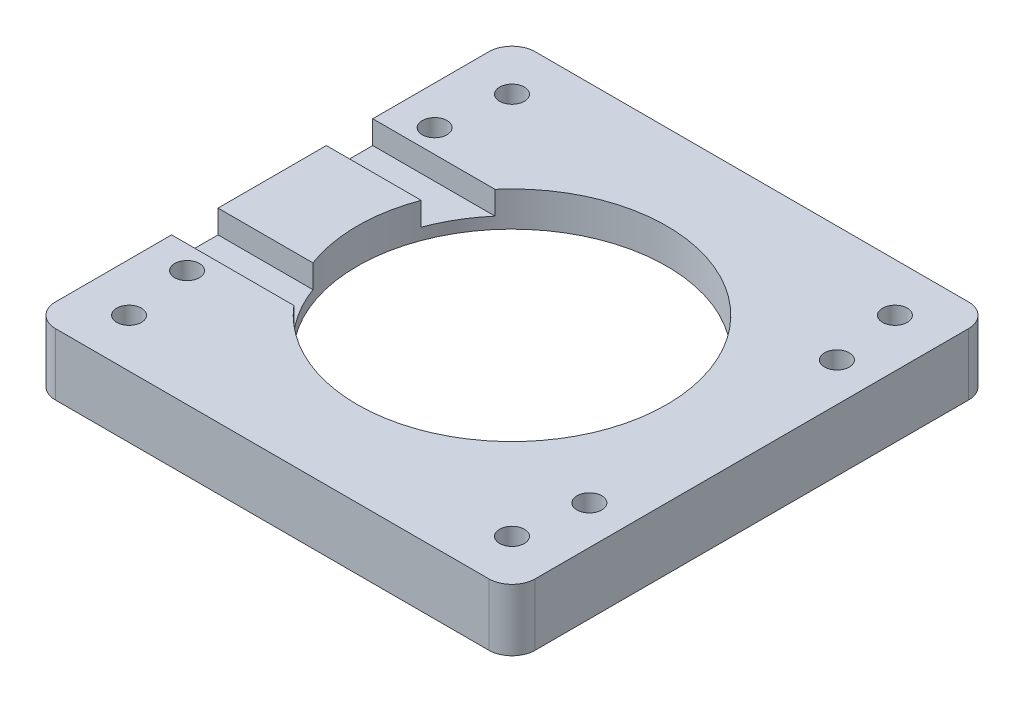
ISO-10303-21;
HEADER;
FILE_DESCRIPTION(('STEP AP214'),'2;1');
FILE_NAME('part.step','',(''),(''),'','','');
FILE_SCHEMA(('AUTOMOTIVE_DESIGN { 1 0 10303 214 1 1 1 1 }'));
ENDSEC;
DATA;
#1=APPLICATION_CONTEXT('core data for automotive mechanical design processes');
#2=APPLICATION_PROTOCOL_DEFINITION('international standard','automotive_design',2000,#1);
#3=PRODUCT_CONTEXT('',#1,'mechanical');
#4=PRODUCT('Part','Part','',(#3));
#5=PRODUCT_RELATED_PRODUCT_CATEGORY('part','',(#4));
#6=PRODUCT_DEFINITION_FORMATION('','',#4);
#7=PRODUCT_DEFINITION_CONTEXT('part definition',#1,'design');
#8=PRODUCT_DEFINITION('design','',#6,#7);
#9=PRODUCT_DEFINITION_SHAPE('','',#8);
#10=(LENGTH_UNIT() NAMED_UNIT(*) SI_UNIT(.MILLI.,.METRE.));
#11=(NAMED_UNIT(*) PLANE_ANGLE_UNIT() SI_UNIT($,.RADIAN.));
#12=(NAMED_UNIT(*) SI_UNIT($,.STERADIAN.) SOLID_ANGLE_UNIT());
#13=UNCERTAINTY_MEASURE_WITH_UNIT(LENGTH_MEASURE(1.E-05),#10,'distance_accuracy_value','');
#14=(GEOMETRIC_REPRESENTATION_CONTEXT(3) GLOBAL_UNCERTAINTY_ASSIGNED_CONTEXT((#13)) GLOBAL_UNIT_ASSIGNED_CONTEXT((#10,
#11,#12)) REPRESENTATION_CONTEXT('',''));
#15=CARTESIAN_POINT('',(0.,0.,0.));
#16=DIRECTION('',(0.,0.,1.));
#17=DIRECTION('',(1.,0.,0.));
#18=AXIS2_PLACEMENT_3D('',#15,#16,#17);
#19=CARTESIAN_POINT('',(-49.919363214,-4.5,80.366322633));
#20=DIRECTION('',(0.,-1.,0.));
#21=DIRECTION('',(0.,0.,-1.));
#22=AXIS2_PLACEMENT_3D('',#19,#20,#21);
#23=PLANE('',#22);
#24=CARTESIAN_POINT('',(-24.619363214,-4.5,55.066322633));
#25=DIRECTION('',(0.,1.,0.));
#26=DIRECTION('',(0.,0.,1.));
#27=AXIS2_PLACEMENT_3D('',#24,#25,#26);
#28=CIRCLE('',#27,20.);
#29=CARTESIAN_POINT('',(-24.619363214,-4.5,75.066322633));
#30=VERTEX_POINT('',#29);
#31=EDGE_CURVE('E21',#30,#30,#28,.F.);
#32=ORIENTED_EDGE('',*,*,#31,.F.);
#33=EDGE_LOOP('',(#32));
#34=FACE_BOUND('',#33,.T.);
#35=CARTESIAN_POINT('',(-24.619363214,-4.5,55.066322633));
#36=DIRECTION('',(0.,-1.,0.));
#37=DIRECTION('',(0.,0.,-1.));
#38=AXIS2_PLACEMENT_3D('',#35,#36,#37);
#39=CIRCLE('',#38,25.);
#40=CARTESIAN_POINT('',(-24.619363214,-4.5,30.066322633));
#41=VERTEX_POINT('',#40);
#42=EDGE_CURVE('E232',#41,#41,#39,.F.);
#43=ORIENTED_EDGE('',*,*,#42,.F.);
#44=EDGE_LOOP('',(#43));
#45=FACE_BOUND('',#44,.T.);
#46=ADVANCED_FACE('F17',(#34,#45),#23,.T.);
#47=CARTESIAN_POINT('',(-43.354357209,-3.,62.066322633));
#48=DIRECTION('',(0.,0.,-1.));
#49=DIRECTION('',(-1.,0.,0.));
#50=AXIS2_PLACEMENT_3D('',#47,#48,#49);
#51=PLANE('',#50);
#52=DIRECTION('',(0.,1.,0.));
#53=VECTOR('',#52,1.);
#54=CARTESIAN_POINT('',(-55.619363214,-4.,62.066322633));
#55=LINE('',#54,#53);
#56=CARTESIAN_POINT('',(-55.619363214,-3.,62.066322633));
#57=VERTEX_POINT('',#56);
#58=CARTESIAN_POINT('',(-55.619363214,0.,62.066322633));
#59=VERTEX_POINT('',#58);
#60=EDGE_CURVE('E235',#57,#59,#55,.T.);
#61=ORIENTED_EDGE('',*,*,#60,.F.);
#62=DIRECTION('',(-1.,0.,0.));
#63=VECTOR('',#62,1.);
#64=CARTESIAN_POINT('',(-47.671301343,-3.,62.066322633));
#65=LINE('',#64,#63);
#66=CARTESIAN_POINT('',(-43.3543572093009,-3.00000000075,62.0663226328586));
#67=VERTEX_POINT('',#66);
#68=EDGE_CURVE('E122',#67,#57,#65,.T.);
#69=ORIENTED_EDGE('',*,*,#68,.F.);
#70=DIRECTION('',(0.,1.,0.));
#71=VECTOR('',#70,1.);
#72=CARTESIAN_POINT('',(-43.3543572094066,-2.25,62.0663226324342));
#73=LINE('',#72,#71);
#74=CARTESIAN_POINT('',(-43.3543572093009,0.,62.0663226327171));
#75=VERTEX_POINT('',#74);
#76=EDGE_CURVE('E137',#75,#67,#73,.F.);
#77=ORIENTED_EDGE('',*,*,#76,.F.);
#78=DIRECTION('',(1.,0.,0.));
#79=VECTOR('',#78,1.);
#80=CARTESIAN_POINT('',(-49.4500651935,0.,62.066322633));
#81=LINE('',#80,#79);
#82=EDGE_CURVE('E315',#59,#75,#81,.T.);
#83=ORIENTED_EDGE('',*,*,#82,.F.);
#84=EDGE_LOOP('',(#61,#69,#77,#83));
#85=FACE_BOUND('',#84,.T.);
#86=ADVANCED_FACE('F249',(#85),#51,.F.);
#87=CARTESIAN_POINT('',(-55.619363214,0.,48.066322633));
#88=DIRECTION('',(0.,1.,0.));
#89=DIRECTION('',(0.,0.,1.));
#90=AXIS2_PLACEMENT_3D('',#87,#88,#89);
#91=PLANE('',#90);
#92=DIRECTION('',(-1.,0.,0.));
#93=VECTOR('',#92,1.);
#94=CARTESIAN_POINT('',(-49.4868602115,0.,48.066322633));
#95=LINE('',#94,#93);
#96=CARTESIAN_POINT('',(-43.3543572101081,0.,48.0663226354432));
#97=VERTEX_POINT('',#96);
#98=CARTESIAN_POINT('',(-55.619363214,0.,48.066322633));
#99=VERTEX_POINT('',#98);
#100=EDGE_CURVE('E123',#97,#99,#95,.T.);
#101=ORIENTED_EDGE('',*,*,#100,.T.);
#102=DIRECTION('',(0.,0.,-1.));
#103=VECTOR('',#102,1.);
#104=CARTESIAN_POINT('',(-55.619363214,0.,55.066322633));
#105=LINE('',#104,#103);
#106=EDGE_CURVE('E311',#59,#99,#105,.T.);
#107=ORIENTED_EDGE('',*,*,#106,.F.);
#108=ORIENTED_EDGE('',*,*,#82,.T.);
#109=CARTESIAN_POINT('',(-24.619363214,0.,55.066322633));
#110=DIRECTION('',(0.,1.,0.));
#111=DIRECTION('',(0.,0.,1.));
#112=AXIS2_PLACEMENT_3D('',#109,#110,#111);
#113=CIRCLE('',#112,20.);
#114=EDGE_CURVE('E135',#97,#75,#113,.T.);
#115=ORIENTED_EDGE('',*,*,#114,.F.);
#116=EDGE_LOOP('',(#101,#107,#108,#115));
#117=FACE_BOUND('',#116,.T.);
#118=ADVANCED_FACE('F333',(#117),#91,.T.);
#119=CARTESIAN_POINT('',(-55.619363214,-3.,48.066322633));
#120=DIRECTION('',(0.,0.,1.));
#121=DIRECTION('',(1.,0.,0.));
#122=AXIS2_PLACEMENT_3D('',#119,#120,#121);
#123=PLANE('',#122);
#124=DIRECTION('',(0.,-1.,0.));
#125=VECTOR('',#124,1.);
#126=CARTESIAN_POINT('',(-43.3543572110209,-2.25,48.0663226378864));
#127=LINE('',#126,#125);
#128=CARTESIAN_POINT('',(-43.3543572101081,-3.0000000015,48.0663226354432));
#129=VERTEX_POINT('',#128);
#130=EDGE_CURVE('E130',#129,#97,#127,.F.);
#131=ORIENTED_EDGE('',*,*,#130,.F.);
#132=DIRECTION('',(1.,0.,0.));
#133=VECTOR('',#132,1.);
#134=CARTESIAN_POINT('',(-47.671301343,-3.,48.066322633));
#135=LINE('',#134,#133);
#136=CARTESIAN_POINT('',(-55.619363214,-3.,48.066322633));
#137=VERTEX_POINT('',#136);
#138=EDGE_CURVE('E112',#137,#129,#135,.T.);
#139=ORIENTED_EDGE('',*,*,#138,.F.);
#140=DIRECTION('',(0.,-1.,0.));
#141=VECTOR('',#140,1.);
#142=CARTESIAN_POINT('',(-55.619363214,-4.,48.066322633));
#143=LINE('',#142,#141);
#144=EDGE_CURVE('E304',#99,#137,#143,.T.);
#145=ORIENTED_EDGE('',*,*,#144,.F.);
#146=ORIENTED_EDGE('',*,*,#100,.F.);
#147=EDGE_LOOP('',(#131,#139,#145,#146));
#148=FACE_BOUND('',#147,.T.);
#149=ADVANCED_FACE('F133',(#148),#123,.F.);
#150=CARTESIAN_POINT('',(-55.619363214,-3.,42.066322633));
#151=DIRECTION('',(0.,1.,0.));
#152=DIRECTION('',(0.,0.,1.));
#153=AXIS2_PLACEMENT_3D('',#150,#151,#152);
#154=PLANE('',#153);
#155=ORIENTED_EDGE('',*,*,#138,.T.);
#156=CARTESIAN_POINT('',(-24.619363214,-3.0000000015,55.066322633));
#157=DIRECTION('',(0.,1.,0.));
#158=DIRECTION('',(0.,0.,1.));
#159=AXIS2_PLACEMENT_3D('',#156,#157,#158);
#160=CIRCLE('',#159,20.);
#161=CARTESIAN_POINT('',(-39.818047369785,-3.0000000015,42.0663226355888));
#162=VERTEX_POINT('',#161);
#163=EDGE_CURVE('E115',#162,#129,#160,.T.);
#164=ORIENTED_EDGE('',*,*,#163,.F.);
#165=DIRECTION('',(-1.,0.,0.));
#166=VECTOR('',#165,1.);
#167=CARTESIAN_POINT('',(-47.7187052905,-3.,42.066322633));
#168=LINE('',#167,#166);
#169=CARTESIAN_POINT('',(-55.619363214,-3.,42.0663226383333));
#170=VERTEX_POINT('',#169);
#171=EDGE_CURVE('E105',#162,#170,#168,.T.);
#172=ORIENTED_EDGE('',*,*,#171,.T.);
#173=DIRECTION('',(0.,0.,-1.));
#174=VECTOR('',#173,1.);
#175=CARTESIAN_POINT('',(-55.619363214,-3.,55.066322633));
#176=LINE('',#175,#174);
#177=EDGE_CURVE('E118',#137,#170,#176,.T.);
#178=ORIENTED_EDGE('',*,*,#177,.F.);
#179=EDGE_LOOP('',(#155,#164,#172,#178));
#180=FACE_BOUND('',#179,.T.);
#181=ADVANCED_FACE('F114',(#180),#154,.T.);
#182=CARTESIAN_POINT('',(-55.619363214,-3.,62.066322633));
#183=DIRECTION('',(0.,1.,0.));
#184=DIRECTION('',(0.,0.,1.));
#185=AXIS2_PLACEMENT_3D('',#182,#183,#184);
#186=PLANE('',#185);
#187=CARTESIAN_POINT('',(-24.619363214,-3.0000000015,55.066322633));
#188=DIRECTION('',(0.,1.,0.));
#189=DIRECTION('',(0.,0.,1.));
#190=AXIS2_PLACEMENT_3D('',#187,#188,#189);
#191=CIRCLE('',#190,20.);
#192=CARTESIAN_POINT('',(-39.818047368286,-3.00000000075,68.0663226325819));
#193=VERTEX_POINT('',#192);
#194=EDGE_CURVE('E237',#67,#193,#191,.T.);
#195=ORIENTED_EDGE('',*,*,#194,.F.);
#196=ORIENTED_EDGE('',*,*,#68,.T.);
#197=DIRECTION('',(0.,0.,-1.));
#198=VECTOR('',#197,1.);
#199=CARTESIAN_POINT('',(-55.619363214,-3.,55.066322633));
#200=LINE('',#199,#198);
#201=CARTESIAN_POINT('',(-55.619363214,-3.,68.066322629));
#202=VERTEX_POINT('',#201);
#203=EDGE_CURVE('E260',#202,#57,#200,.T.);
#204=ORIENTED_EDGE('',*,*,#203,.F.);
#205=DIRECTION('',(1.,0.,0.));
#206=VECTOR('',#205,1.);
#207=CARTESIAN_POINT('',(-47.7187052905,-3.,68.066322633));
#208=LINE('',#207,#206);
#209=EDGE_CURVE('E254',#202,#193,#208,.T.);
#210=ORIENTED_EDGE('',*,*,#209,.T.);
#211=EDGE_LOOP('',(#195,#196,#204,#210));
#212=FACE_BOUND('',#211,.T.);
#213=ADVANCED_FACE('F256',(#212),#186,.T.);
#214=CARTESIAN_POINT('',(-55.619363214,-3.,68.066322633));
#215=DIRECTION('',(0.,0.,1.));
#216=DIRECTION('',(1.,0.,0.));
#217=AXIS2_PLACEMENT_3D('',#214,#215,#216);
#218=PLANE('',#217);
#219=DIRECTION('',(0.,-1.,0.));
#220=VECTOR('',#219,1.);
#221=CARTESIAN_POINT('',(-39.8180473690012,-2.25,68.0663226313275));
#222=LINE('',#221,#220);
#223=CARTESIAN_POINT('',(-39.8180473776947,0.,68.0663226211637));
#224=VERTEX_POINT('',#223);
#225=EDGE_CURVE('E238',#193,#224,#222,.F.);
#226=ORIENTED_EDGE('',*,*,#225,.F.);
#227=ORIENTED_EDGE('',*,*,#209,.F.);
#228=DIRECTION('',(0.,-1.,0.));
#229=VECTOR('',#228,1.);
#230=CARTESIAN_POINT('',(-55.619363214,-4.,68.066322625));
#231=LINE('',#230,#229);
#232=CARTESIAN_POINT('',(-55.619363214,0.,68.0663226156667));
#233=VERTEX_POINT('',#232);
#234=EDGE_CURVE('E289',#233,#202,#231,.T.);
#235=ORIENTED_EDGE('',*,*,#234,.F.);
#236=DIRECTION('',(-1.,0.,0.));
#237=VECTOR('',#236,1.);
#238=CARTESIAN_POINT('',(-24.619363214,0.,68.066322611));
#239=LINE('',#238,#237);
#240=EDGE_CURVE('E268',#224,#233,#239,.T.);
#241=ORIENTED_EDGE('',*,*,#240,.F.);
#242=EDGE_LOOP('',(#226,#227,#235,#241));
#243=FACE_BOUND('',#242,.T.);
#244=ADVANCED_FACE('F266',(#243),#218,.F.);
#245=CARTESIAN_POINT('',(-39.818047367,-3.,42.066322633));
#246=DIRECTION('',(0.,0.,-1.));
#247=DIRECTION('',(-1.,0.,0.));
#248=AXIS2_PLACEMENT_3D('',#245,#246,#247);
#249=PLANE('',#248);
#250=DIRECTION('',(0.,1.,0.));
#251=VECTOR('',#250,1.);
#252=CARTESIAN_POINT('',(-55.619363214,-4.,42.066322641));
#253=LINE('',#252,#251);
#254=CARTESIAN_POINT('',(-55.619363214,0.,42.0663226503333));
#255=VERTEX_POINT('',#254);
#256=EDGE_CURVE('E283',#170,#255,#253,.T.);
#257=ORIENTED_EDGE('',*,*,#256,.F.);
#258=ORIENTED_EDGE('',*,*,#171,.F.);
#259=DIRECTION('',(0.,1.,0.));
#260=VECTOR('',#259,1.);
#261=CARTESIAN_POINT('',(-39.8180473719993,-2.25,42.0663226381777));
#262=LINE('',#261,#260);
#263=CARTESIAN_POINT('',(-39.8180473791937,0.,42.0663226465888));
#264=VERTEX_POINT('',#263);
#265=EDGE_CURVE('E132',#264,#162,#262,.F.);
#266=ORIENTED_EDGE('',*,*,#265,.F.);
#267=DIRECTION('',(1.,0.,0.));
#268=VECTOR('',#267,1.);
#269=CARTESIAN_POINT('',(-24.619363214,0.,42.066322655));
#270=LINE('',#269,#268);
#271=EDGE_CURVE('E223',#255,#264,#270,.T.);
#272=ORIENTED_EDGE('',*,*,#271,.F.);
#273=EDGE_LOOP('',(#257,#258,#266,#272));
#274=FACE_BOUND('',#273,.T.);
#275=ADVANCED_FACE('F278',(#274),#249,.F.);
#276=CARTESIAN_POINT('',(-24.619363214,-4.5,55.066322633));
#277=DIRECTION('',(0.,1.,0.));
#278=DIRECTION('',(0.,0.,1.));
#279=AXIS2_PLACEMENT_3D('',#276,#277,#278);
#280=CYLINDRICAL_SURFACE('',#279,20.);
#281=CARTESIAN_POINT('',(-24.619363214,0.,55.066322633));
#282=DIRECTION('',(0.,1.,0.));
#283=DIRECTION('',(0.,0.,1.));
#284=AXIS2_PLACEMENT_3D('',#281,#282,#283);
#285=CIRCLE('',#284,20.);
#286=EDGE_CURVE('E220',#264,#224,#285,.F.);
#287=ORIENTED_EDGE('',*,*,#286,.F.);
#288=ORIENTED_EDGE('',*,*,#265,.T.);
#289=ORIENTED_EDGE('',*,*,#163,.T.);
#290=ORIENTED_EDGE('',*,*,#130,.T.);
#291=ORIENTED_EDGE('',*,*,#114,.T.);
#292=ORIENTED_EDGE('',*,*,#76,.T.);
#293=ORIENTED_EDGE('',*,*,#194,.T.);
#294=ORIENTED_EDGE('',*,*,#225,.T.);
#295=EDGE_LOOP('',(#287,#288,#289,#290,#291,#292,#293,#294));
#296=FACE_BOUND('',#295,.T.);
#297=ORIENTED_EDGE('',*,*,#31,.T.);
#298=EDGE_LOOP('',(#297));
#299=FACE_BOUND('',#298,.T.);
#300=ADVANCED_FACE('F127',(#296,#299),#280,.F.);
#301=CARTESIAN_POINT('',(6.380636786,-8.,83.066322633));
#302=DIRECTION('',(1.,0.,0.));
#303=DIRECTION('',(0.,0.,-1.));
#304=AXIS2_PLACEMENT_3D('',#301,#302,#303);
#305=PLANE('',#304);
#306=DIRECTION('',(0.,0.,-1.));
#307=VECTOR('',#306,1.);
#308=CARTESIAN_POINT('',(6.380636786,-8.,55.066322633));
#309=LINE('',#308,#307);
#310=CARTESIAN_POINT('',(6.380636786,-8.,83.0663226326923));
#311=VERTEX_POINT('',#310);
#312=CARTESIAN_POINT('',(6.380636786,-8.,27.0663226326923));
#313=VERTEX_POINT('',#312);
#314=EDGE_CURVE('E191',#311,#313,#309,.T.);
#315=ORIENTED_EDGE('',*,*,#314,.T.);
#316=DIRECTION('',(0.,-1.,0.));
#317=VECTOR('',#316,1.);
#318=CARTESIAN_POINT('',(6.380636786,-4.,27.0663226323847));
#319=LINE('',#318,#317);
#320=CARTESIAN_POINT('',(6.380636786,0.,27.0663226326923));
#321=VERTEX_POINT('',#320);
#322=EDGE_CURVE('E195',#313,#321,#319,.F.);
#323=ORIENTED_EDGE('',*,*,#322,.T.);
#324=DIRECTION('',(0.,0.,-1.));
#325=VECTOR('',#324,1.);
#326=CARTESIAN_POINT('',(6.380636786,0.,55.066322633));
#327=LINE('',#326,#325);
#328=CARTESIAN_POINT('',(6.380636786,0.,83.0663226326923));
#329=VERTEX_POINT('',#328);
#330=EDGE_CURVE('E227',#329,#321,#327,.T.);
#331=ORIENTED_EDGE('',*,*,#330,.F.);
#332=DIRECTION('',(0.,1.,0.));
#333=VECTOR('',#332,1.);
#334=CARTESIAN_POINT('',(6.38063678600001,-4.,83.0663226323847));
#335=LINE('',#334,#333);
#336=EDGE_CURVE('E384',#329,#311,#335,.F.);
#337=ORIENTED_EDGE('',*,*,#336,.T.);
#338=EDGE_LOOP('',(#315,#323,#331,#337));
#339=FACE_BOUND('',#338,.T.);
#340=ADVANCED_FACE('F394',(#339),#305,.T.);
#341=CARTESIAN_POINT('',(-52.619363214,-8.,83.066322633));
#342=DIRECTION('',(0.,1.,0.));
#343=DIRECTION('',(0.,0.,1.));
#344=AXIS2_PLACEMENT_3D('',#341,#342,#343);
#345=CYLINDRICAL_SURFACE('',#344,3.);
#346=DIRECTION('',(0.,1.,0.));
#347=VECTOR('',#346,1.);
#348=CARTESIAN_POINT('',(-55.619363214,-4.,83.066322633));
#349=LINE('',#348,#347);
#350=CARTESIAN_POINT('',(-55.619363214,-8.,83.066322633));
#351=VERTEX_POINT('',#350);
#352=CARTESIAN_POINT('',(-55.619363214,0.,83.066322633));
#353=VERTEX_POINT('',#352);
#354=EDGE_CURVE('E286',#351,#353,#349,.T.);
#355=ORIENTED_EDGE('',*,*,#354,.F.);
#356=CARTESIAN_POINT('',(-52.619363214,-8.,83.066322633));
#357=DIRECTION('',(0.,1.,0.));
#358=DIRECTION('',(0.,0.,1.));
#359=AXIS2_PLACEMENT_3D('',#356,#357,#358);
#360=CIRCLE('',#359,3.);
#361=CARTESIAN_POINT('',(-52.619363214,-8.,86.066322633));
#362=VERTEX_POINT('',#361);
#363=EDGE_CURVE('E184',#351,#362,#360,.T.);
#364=ORIENTED_EDGE('',*,*,#363,.T.);
#365=DIRECTION('',(0.,-1.,0.));
#366=VECTOR('',#365,1.);
#367=CARTESIAN_POINT('',(-52.619363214,-4.,86.066322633));
#368=LINE('',#367,#366);
#369=CARTESIAN_POINT('',(-52.619363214,0.,86.066322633));
#370=VERTEX_POINT('',#369);
#371=EDGE_CURVE('E241',#370,#362,#368,.T.);
#372=ORIENTED_EDGE('',*,*,#371,.F.);
#373=CARTESIAN_POINT('',(-52.619363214,0.,83.066322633));
#374=DIRECTION('',(0.,1.,0.));
#375=DIRECTION('',(0.,0.,1.));
#376=AXIS2_PLACEMENT_3D('',#373,#374,#375);
#377=CIRCLE('',#376,3.);
#378=EDGE_CURVE('E229',#353,#370,#377,.T.);
#379=ORIENTED_EDGE('',*,*,#378,.F.);
#380=EDGE_LOOP('',(#355,#364,#372,#379));
#381=FACE_BOUND('',#380,.T.);
#382=ADVANCED_FACE('F418',(#381),#345,.T.);
#383=CARTESIAN_POINT('',(-52.619363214,-8.,86.066322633));
#384=DIRECTION('',(0.,0.,1.));
#385=DIRECTION('',(1.,0.,0.));
#386=AXIS2_PLACEMENT_3D('',#383,#384,#385);
#387=PLANE('',#386);
#388=DIRECTION('',(1.,0.,0.));
#389=VECTOR('',#388,1.);
#390=CARTESIAN_POINT('',(-24.619363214,-8.,86.066322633));
#391=LINE('',#390,#389);
#392=CARTESIAN_POINT('',(3.380636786,-8.,86.066322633));
#393=VERTEX_POINT('',#392);
#394=EDGE_CURVE('E183',#362,#393,#391,.T.);
#395=ORIENTED_EDGE('',*,*,#394,.T.);
#396=DIRECTION('',(0.,-1.,0.));
#397=VECTOR('',#396,1.);
#398=CARTESIAN_POINT('',(3.380636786,-4.,86.066322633));
#399=LINE('',#398,#397);
#400=CARTESIAN_POINT('',(3.380636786,0.,86.066322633));
#401=VERTEX_POINT('',#400);
#402=EDGE_CURVE('E236',#393,#401,#399,.F.);
#403=ORIENTED_EDGE('',*,*,#402,.T.);
#404=DIRECTION('',(1.,0.,0.));
#405=VECTOR('',#404,1.);
#406=CARTESIAN_POINT('',(-24.619363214,0.,86.066322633));
#407=LINE('',#406,#405);
#408=EDGE_CURVE('E228',#370,#401,#407,.T.);
#409=ORIENTED_EDGE('',*,*,#408,.F.);
#410=ORIENTED_EDGE('',*,*,#371,.T.);
#411=EDGE_LOOP('',(#395,#403,#409,#410));
#412=FACE_BOUND('',#411,.T.);
#413=ADVANCED_FACE('F410',(#412),#387,.T.);
#414=CARTESIAN_POINT('',(3.380636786,-8.,83.066322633));
#415=DIRECTION('',(0.,1.,0.));
#416=DIRECTION('',(0.,0.,1.));
#417=AXIS2_PLACEMENT_3D('',#414,#415,#416);
#418=CYLINDRICAL_SURFACE('',#417,3.);
#419=ORIENTED_EDGE('',*,*,#402,.F.);
#420=CARTESIAN_POINT('',(3.380636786,-8.,83.066322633));
#421=DIRECTION('',(0.,1.,0.));
#422=DIRECTION('',(0.,0.,1.));
#423=AXIS2_PLACEMENT_3D('',#420,#421,#422);
#424=CIRCLE('',#423,3.);
#425=EDGE_CURVE('E180',#393,#311,#424,.T.);
#426=ORIENTED_EDGE('',*,*,#425,.T.);
#427=ORIENTED_EDGE('',*,*,#336,.F.);
#428=CARTESIAN_POINT('',(3.380636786,0.,83.066322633));
#429=DIRECTION('',(0.,1.,0.));
#430=DIRECTION('',(0.,0.,1.));
#431=AXIS2_PLACEMENT_3D('',#428,#429,#430);
#432=CIRCLE('',#431,3.);
#433=EDGE_CURVE('E224',#401,#329,#432,.T.);
#434=ORIENTED_EDGE('',*,*,#433,.F.);
#435=EDGE_LOOP('',(#419,#426,#427,#434));
#436=FACE_BOUND('',#435,.T.);
#437=ADVANCED_FACE('F407',(#436),#418,.T.);
#438=CARTESIAN_POINT('',(-24.619363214,-4.5,55.066322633));
#439=DIRECTION('',(0.,-1.,0.));
#440=DIRECTION('',(0.,0.,-1.));
#441=AXIS2_PLACEMENT_3D('',#438,#439,#440);
#442=CYLINDRICAL_SURFACE('',#441,25.);
#443=ORIENTED_EDGE('',*,*,#42,.T.);
#444=EDGE_LOOP('',(#443));
#445=FACE_BOUND('',#444,.T.);
#446=CARTESIAN_POINT('',(-24.619363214,-8.,55.066322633));
#447=DIRECTION('',(0.,-1.,0.));
#448=DIRECTION('',(0.,0.,-1.));
#449=AXIS2_PLACEMENT_3D('',#446,#447,#448);
#450=CIRCLE('',#449,25.);
#451=CARTESIAN_POINT('',(-24.619363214,-8.,30.066322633));
#452=VERTEX_POINT('',#451);
#453=EDGE_CURVE('E177',#452,#452,#450,.T.);
#454=ORIENTED_EDGE('',*,*,#453,.T.);
#455=EDGE_LOOP('',(#454));
#456=FACE_BOUND('',#455,.T.);
#457=ADVANCED_FACE('F486',(#445,#456),#442,.F.);
#458=CARTESIAN_POINT('',(-49.368100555,-8.,79.815059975));
#459=DIRECTION('',(0.,1.,0.));
#460=DIRECTION('',(0.,0.,1.));
#461=AXIS2_PLACEMENT_3D('',#458,#459,#460);
#462=CYLINDRICAL_SURFACE('',#461,1.6);
#463=CARTESIAN_POINT('',(-49.368100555,-8.,79.815059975));
#464=DIRECTION('',(0.,1.,0.));
#465=DIRECTION('',(0.,0.,1.));
#466=AXIS2_PLACEMENT_3D('',#463,#464,#465);
#467=CIRCLE('',#466,1.6);
#468=CARTESIAN_POINT('',(-49.368100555,-8.,81.415059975));
#469=VERTEX_POINT('',#468);
#470=EDGE_CURVE('E174',#469,#469,#467,.F.);
#471=ORIENTED_EDGE('',*,*,#470,.T.);
#472=EDGE_LOOP('',(#471));
#473=FACE_BOUND('',#472,.T.);
#474=CARTESIAN_POINT('',(-49.368100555,0.,79.815059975));
#475=DIRECTION('',(0.,1.,0.));
#476=DIRECTION('',(0.,0.,1.));
#477=AXIS2_PLACEMENT_3D('',#474,#475,#476);
#478=CIRCLE('',#477,1.6);
#479=CARTESIAN_POINT('',(-49.368100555,0.,81.415059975));
#480=VERTEX_POINT('',#479);
#481=EDGE_CURVE('E217',#480,#480,#478,.F.);
#482=ORIENTED_EDGE('',*,*,#481,.F.);
#483=EDGE_LOOP('',(#482));
#484=FACE_BOUND('',#483,.T.);
#485=ADVANCED_FACE('F482',(#473,#484),#462,.F.);
#486=CARTESIAN_POINT('',(-50.619363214,-8.,71.066322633));
#487=DIRECTION('',(0.,1.,0.));
#488=DIRECTION('',(0.,0.,1.));
#489=AXIS2_PLACEMENT_3D('',#486,#487,#488);
#490=CYLINDRICAL_SURFACE('',#489,1.59999999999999);
#491=CARTESIAN_POINT('',(-50.619363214,-8.,71.066322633));
#492=DIRECTION('',(0.,1.,0.));
#493=DIRECTION('',(0.,0.,1.));
#494=AXIS2_PLACEMENT_3D('',#491,#492,#493);
#495=CIRCLE('',#494,1.59999999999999);
#496=CARTESIAN_POINT('',(-50.619363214,-8.,72.666322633));
#497=VERTEX_POINT('',#496);
#498=EDGE_CURVE('E171',#497,#497,#495,.F.);
#499=ORIENTED_EDGE('',*,*,#498,.T.);
#500=EDGE_LOOP('',(#499));
#501=FACE_BOUND('',#500,.T.);
#502=CARTESIAN_POINT('',(-50.619363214,0.,71.066322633));
#503=DIRECTION('',(0.,1.,0.));
#504=DIRECTION('',(0.,0.,1.));
#505=AXIS2_PLACEMENT_3D('',#502,#503,#504);
#506=CIRCLE('',#505,1.59999999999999);
#507=CARTESIAN_POINT('',(-50.619363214,0.,72.666322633));
#508=VERTEX_POINT('',#507);
#509=EDGE_CURVE('E214',#508,#508,#506,.F.);
#510=ORIENTED_EDGE('',*,*,#509,.F.);
#511=EDGE_LOOP('',(#510));
#512=FACE_BOUND('',#511,.T.);
#513=ADVANCED_FACE('F478',(#501,#512),#490,.F.);
#514=CARTESIAN_POINT('',(1.380636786,-8.,71.066322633));
#515=DIRECTION('',(0.,1.,0.));
#516=DIRECTION('',(0.,0.,1.));
#517=AXIS2_PLACEMENT_3D('',#514,#515,#516);
#518=CYLINDRICAL_SURFACE('',#517,1.59999999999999);
#519=CARTESIAN_POINT('',(1.380636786,-8.,71.066322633));
#520=DIRECTION('',(0.,1.,0.));
#521=DIRECTION('',(0.,0.,1.));
#522=AXIS2_PLACEMENT_3D('',#519,#520,#521);
#523=CIRCLE('',#522,1.59999999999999);
#524=CARTESIAN_POINT('',(1.380636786,-8.,72.666322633));
#525=VERTEX_POINT('',#524);
#526=EDGE_CURVE('E168',#525,#525,#523,.F.);
#527=ORIENTED_EDGE('',*,*,#526,.T.);
#528=EDGE_LOOP('',(#527));
#529=FACE_BOUND('',#528,.T.);
#530=CARTESIAN_POINT('',(1.380636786,0.,71.066322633));
#531=DIRECTION('',(0.,1.,0.));
#532=DIRECTION('',(0.,0.,1.));
#533=AXIS2_PLACEMENT_3D('',#530,#531,#532);
#534=CIRCLE('',#533,1.59999999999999);
#535=CARTESIAN_POINT('',(1.380636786,0.,72.666322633));
#536=VERTEX_POINT('',#535);
#537=EDGE_CURVE('E211',#536,#536,#534,.F.);
#538=ORIENTED_EDGE('',*,*,#537,.F.);
#539=EDGE_LOOP('',(#538));
#540=FACE_BOUND('',#539,.T.);
#541=ADVANCED_FACE('F474',(#529,#540),#518,.F.);
#542=CARTESIAN_POINT('',(0.129374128,-8.,79.815059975));
#543=DIRECTION('',(0.,1.,0.));
#544=DIRECTION('',(0.,0.,1.));
#545=AXIS2_PLACEMENT_3D('',#542,#543,#544);
#546=CYLINDRICAL_SURFACE('',#545,1.6);
#547=CARTESIAN_POINT('',(0.129374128,-8.,79.815059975));
#548=DIRECTION('',(0.,1.,0.));
#549=DIRECTION('',(0.,0.,1.));
#550=AXIS2_PLACEMENT_3D('',#547,#548,#549);
#551=CIRCLE('',#550,1.6);
#552=CARTESIAN_POINT('',(0.129374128,-8.,81.415059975));
#553=VERTEX_POINT('',#552);
#554=EDGE_CURVE('E165',#553,#553,#551,.F.);
#555=ORIENTED_EDGE('',*,*,#554,.T.);
#556=EDGE_LOOP('',(#555));
#557=FACE_BOUND('',#556,.T.);
#558=CARTESIAN_POINT('',(0.129374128,0.,79.815059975));
#559=DIRECTION('',(0.,1.,0.));
#560=DIRECTION('',(0.,0.,1.));
#561=AXIS2_PLACEMENT_3D('',#558,#559,#560);
#562=CIRCLE('',#561,1.6);
#563=CARTESIAN_POINT('',(0.129374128,0.,81.415059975));
#564=VERTEX_POINT('',#563);
#565=EDGE_CURVE('E208',#564,#564,#562,.F.);
#566=ORIENTED_EDGE('',*,*,#565,.F.);
#567=EDGE_LOOP('',(#566));
#568=FACE_BOUND('',#567,.T.);
#569=ADVANCED_FACE('F470',(#557,#568),#546,.F.);
#570=CARTESIAN_POINT('',(1.380636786,-8.,39.066322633));
#571=DIRECTION('',(0.,1.,0.));
#572=DIRECTION('',(0.,0.,1.));
#573=AXIS2_PLACEMENT_3D('',#570,#571,#572);
#574=CYLINDRICAL_SURFACE('',#573,1.6);
#575=CARTESIAN_POINT('',(1.380636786,-8.,39.066322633));
#576=DIRECTION('',(0.,1.,0.));
#577=DIRECTION('',(0.,0.,1.));
#578=AXIS2_PLACEMENT_3D('',#575,#576,#577);
#579=CIRCLE('',#578,1.6);
#580=CARTESIAN_POINT('',(1.380636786,-8.,40.666322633));
#581=VERTEX_POINT('',#580);
#582=EDGE_CURVE('E162',#581,#581,#579,.F.);
#583=ORIENTED_EDGE('',*,*,#582,.T.);
#584=EDGE_LOOP('',(#583));
#585=FACE_BOUND('',#584,.T.);
#586=CARTESIAN_POINT('',(1.380636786,0.,39.066322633));
#587=DIRECTION('',(0.,1.,0.));
#588=DIRECTION('',(0.,0.,1.));
#589=AXIS2_PLACEMENT_3D('',#586,#587,#588);
#590=CIRCLE('',#589,1.6);
#591=CARTESIAN_POINT('',(1.380636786,0.,40.666322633));
#592=VERTEX_POINT('',#591);
#593=EDGE_CURVE('E205',#592,#592,#590,.F.);
#594=ORIENTED_EDGE('',*,*,#593,.F.);
#595=EDGE_LOOP('',(#594));
#596=FACE_BOUND('',#595,.T.);
#597=ADVANCED_FACE('F466',(#585,#596),#574,.F.);
#598=CARTESIAN_POINT('',(0.129374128,-8.,30.317585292));
#599=DIRECTION('',(0.,1.,0.));
#600=DIRECTION('',(0.,0.,1.));
#601=AXIS2_PLACEMENT_3D('',#598,#599,#600);
#602=CYLINDRICAL_SURFACE('',#601,1.6);
#603=CARTESIAN_POINT('',(0.129374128,-8.,30.317585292));
#604=DIRECTION('',(0.,1.,0.));
#605=DIRECTION('',(0.,0.,1.));
#606=AXIS2_PLACEMENT_3D('',#603,#604,#605);
#607=CIRCLE('',#606,1.6);
#608=CARTESIAN_POINT('',(0.129374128,-8.,31.917585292));
#609=VERTEX_POINT('',#608);
#610=EDGE_CURVE('E159',#609,#609,#607,.F.);
#611=ORIENTED_EDGE('',*,*,#610,.T.);
#612=EDGE_LOOP('',(#611));
#613=FACE_BOUND('',#612,.T.);
#614=CARTESIAN_POINT('',(0.129374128,0.,30.317585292));
#615=DIRECTION('',(0.,1.,0.));
#616=DIRECTION('',(0.,0.,1.));
#617=AXIS2_PLACEMENT_3D('',#614,#615,#616);
#618=CIRCLE('',#617,1.6);
#619=CARTESIAN_POINT('',(0.129374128,0.,31.917585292));
#620=VERTEX_POINT('',#619);
#621=EDGE_CURVE('E202',#620,#620,#618,.F.);
#622=ORIENTED_EDGE('',*,*,#621,.F.);
#623=EDGE_LOOP('',(#622));
#624=FACE_BOUND('',#623,.T.);
#625=ADVANCED_FACE('F462',(#613,#624),#602,.F.);
#626=CARTESIAN_POINT('',(-50.619363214,-8.,39.066322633));
#627=DIRECTION('',(0.,1.,0.));
#628=DIRECTION('',(0.,0.,1.));
#629=AXIS2_PLACEMENT_3D('',#626,#627,#628);
#630=CYLINDRICAL_SURFACE('',#629,1.6);
#631=CARTESIAN_POINT('',(-50.619363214,-8.,39.066322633));
#632=DIRECTION('',(0.,1.,0.));
#633=DIRECTION('',(0.,0.,1.));
#634=AXIS2_PLACEMENT_3D('',#631,#632,#633);
#635=CIRCLE('',#634,1.6);
#636=CARTESIAN_POINT('',(-50.619363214,-8.,40.666322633));
#637=VERTEX_POINT('',#636);
#638=EDGE_CURVE('E156',#637,#637,#635,.F.);
#639=ORIENTED_EDGE('',*,*,#638,.T.);
#640=EDGE_LOOP('',(#639));
#641=FACE_BOUND('',#640,.T.);
#642=CARTESIAN_POINT('',(-50.619363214,0.,39.066322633));
#643=DIRECTION('',(0.,1.,0.));
#644=DIRECTION('',(0.,0.,1.));
#645=AXIS2_PLACEMENT_3D('',#642,#643,#644);
#646=CIRCLE('',#645,1.6);
#647=CARTESIAN_POINT('',(-50.619363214,0.,40.666322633));
#648=VERTEX_POINT('',#647);
#649=EDGE_CURVE('E199',#648,#648,#646,.F.);
#650=ORIENTED_EDGE('',*,*,#649,.F.);
#651=EDGE_LOOP('',(#650));
#652=FACE_BOUND('',#651,.T.);
#653=ADVANCED_FACE('F458',(#641,#652),#630,.F.);
#654=CARTESIAN_POINT('',(-49.368100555,-8.,30.317585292));
#655=DIRECTION('',(0.,1.,0.));
#656=DIRECTION('',(0.,0.,1.));
#657=AXIS2_PLACEMENT_3D('',#654,#655,#656);
#658=CYLINDRICAL_SURFACE('',#657,1.6);
#659=CARTESIAN_POINT('',(-49.368100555,-8.,30.317585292));
#660=DIRECTION('',(0.,1.,0.));
#661=DIRECTION('',(0.,0.,1.));
#662=AXIS2_PLACEMENT_3D('',#659,#660,#661);
#663=CIRCLE('',#662,1.6);
#664=CARTESIAN_POINT('',(-49.368100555,-8.,31.917585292));
#665=VERTEX_POINT('',#664);
#666=EDGE_CURVE('E153',#665,#665,#663,.F.);
#667=ORIENTED_EDGE('',*,*,#666,.T.);
#668=EDGE_LOOP('',(#667));
#669=FACE_BOUND('',#668,.T.);
#670=CARTESIAN_POINT('',(-49.368100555,0.,30.317585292));
#671=DIRECTION('',(0.,1.,0.));
#672=DIRECTION('',(0.,0.,1.));
#673=AXIS2_PLACEMENT_3D('',#670,#671,#672);
#674=CIRCLE('',#673,1.6);
#675=CARTESIAN_POINT('',(-49.368100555,0.,31.917585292));
#676=VERTEX_POINT('',#675);
#677=EDGE_CURVE('E196',#676,#676,#674,.F.);
#678=ORIENTED_EDGE('',*,*,#677,.F.);
#679=EDGE_LOOP('',(#678));
#680=FACE_BOUND('',#679,.T.);
#681=ADVANCED_FACE('F455',(#669,#680),#658,.F.);
#682=CARTESIAN_POINT('',(-55.619363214,-8.,27.066322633));
#683=DIRECTION('',(-1.,0.,0.));
#684=DIRECTION('',(0.,0.,1.));
#685=AXIS2_PLACEMENT_3D('',#682,#683,#684);
#686=PLANE('',#685);
#687=ORIENTED_EDGE('',*,*,#234,.T.);
#688=ORIENTED_EDGE('',*,*,#203,.T.);
#689=ORIENTED_EDGE('',*,*,#60,.T.);
#690=ORIENTED_EDGE('',*,*,#106,.T.);
#691=ORIENTED_EDGE('',*,*,#144,.T.);
#692=ORIENTED_EDGE('',*,*,#177,.T.);
#693=ORIENTED_EDGE('',*,*,#256,.T.);
#694=DIRECTION('',(0.,0.,1.));
#695=VECTOR('',#694,1.);
#696=CARTESIAN_POINT('',(-55.619363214,0.,55.066322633));
#697=LINE('',#696,#695);
#698=CARTESIAN_POINT('',(-55.619363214,0.,27.066322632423));
#699=VERTEX_POINT('',#698);
#700=EDGE_CURVE('E276',#699,#255,#697,.T.);
#701=ORIENTED_EDGE('',*,*,#700,.F.);
#702=DIRECTION('',(0.,1.,0.));
#703=VECTOR('',#702,1.);
#704=CARTESIAN_POINT('',(-55.619363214,-4.,27.0663226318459));
#705=LINE('',#704,#703);
#706=CARTESIAN_POINT('',(-55.619363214,-8.,27.066322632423));
#707=VERTEX_POINT('',#706);
#708=EDGE_CURVE('E152',#699,#707,#705,.F.);
#709=ORIENTED_EDGE('',*,*,#708,.T.);
#710=DIRECTION('',(0.,0.,1.));
#711=VECTOR('',#710,1.);
#712=CARTESIAN_POINT('',(-55.619363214,-8.,55.066322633));
#713=LINE('',#712,#711);
#714=EDGE_CURVE('E187',#707,#351,#713,.T.);
#715=ORIENTED_EDGE('',*,*,#714,.T.);
#716=ORIENTED_EDGE('',*,*,#354,.T.);
#717=DIRECTION('',(0.,0.,1.));
#718=VECTOR('',#717,1.);
#719=CARTESIAN_POINT('',(-55.619363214,0.,55.066322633));
#720=LINE('',#719,#718);
#721=EDGE_CURVE('E231',#233,#353,#720,.T.);
#722=ORIENTED_EDGE('',*,*,#721,.F.);
#723=EDGE_LOOP('',(#687,#688,#689,#690,#691,#692,#693,#701,#709,#715,#716,#722));
#724=FACE_BOUND('',#723,.T.);
#725=ADVANCED_FACE('F328',(#724),#686,.T.);
#726=CARTESIAN_POINT('',(-5.619363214,-4.,35.157742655));
#727=DIRECTION('',(0.,0.,-1.));
#728=DIRECTION('',(-1.,0.,0.));
#729=AXIS2_PLACEMENT_3D('',#726,#727,#728);
#730=CONICAL_SURFACE('',#729,0.,1.02974425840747);
#731=CARTESIAN_POINT('',(-5.619363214,-4.,35.157742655));
#732=VERTEX_POINT('',#731);
#733=VERTEX_LOOP('',#732);
#734=FACE_BOUND('',#733,.T.);
#735=CARTESIAN_POINT('',(-5.619363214,-4.,34.166322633));
#736=DIRECTION('',(0.,0.,-1.));
#737=DIRECTION('',(-1.,0.,0.));
#738=AXIS2_PLACEMENT_3D('',#735,#736,#737);
#739=CIRCLE('',#738,1.65);
#740=CARTESIAN_POINT('',(-7.269363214,-4.,34.166322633));
#741=VERTEX_POINT('',#740);
#742=EDGE_CURVE('E149',#741,#741,#739,.F.);
#743=ORIENTED_EDGE('',*,*,#742,.F.);
#744=EDGE_LOOP('',(#743));
#745=FACE_BOUND('',#744,.T.);
#746=ADVANCED_FACE('F451',(#734,#745),#730,.F.);
#747=CARTESIAN_POINT('',(-55.619363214,0.,24.066322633));
#748=DIRECTION('',(0.,1.,0.));
#749=DIRECTION('',(0.,0.,1.));
#750=AXIS2_PLACEMENT_3D('',#747,#748,#749);
#751=PLANE('',#750);
#752=ORIENTED_EDGE('',*,*,#677,.T.);
#753=EDGE_LOOP('',(#752));
#754=FACE_BOUND('',#753,.T.);
#755=ORIENTED_EDGE('',*,*,#649,.T.);
#756=EDGE_LOOP('',(#755));
#757=FACE_BOUND('',#756,.T.);
#758=ORIENTED_EDGE('',*,*,#621,.T.);
#759=EDGE_LOOP('',(#758));
#760=FACE_BOUND('',#759,.T.);
#761=ORIENTED_EDGE('',*,*,#593,.T.);
#762=EDGE_LOOP('',(#761));
#763=FACE_BOUND('',#762,.T.);
#764=ORIENTED_EDGE('',*,*,#565,.T.);
#765=EDGE_LOOP('',(#764));
#766=FACE_BOUND('',#765,.T.);
#767=ORIENTED_EDGE('',*,*,#537,.T.);
#768=EDGE_LOOP('',(#767));
#769=FACE_BOUND('',#768,.T.);
#770=ORIENTED_EDGE('',*,*,#509,.T.);
#771=EDGE_LOOP('',(#770));
#772=FACE_BOUND('',#771,.T.);
#773=ORIENTED_EDGE('',*,*,#481,.T.);
#774=EDGE_LOOP('',(#773));
#775=FACE_BOUND('',#774,.T.);
#776=ORIENTED_EDGE('',*,*,#271,.T.);
#777=ORIENTED_EDGE('',*,*,#286,.T.);
#778=ORIENTED_EDGE('',*,*,#240,.T.);
#779=ORIENTED_EDGE('',*,*,#721,.T.);
#780=ORIENTED_EDGE('',*,*,#378,.T.);
#781=ORIENTED_EDGE('',*,*,#408,.T.);
#782=ORIENTED_EDGE('',*,*,#433,.T.);
#783=ORIENTED_EDGE('',*,*,#330,.T.);
#784=CARTESIAN_POINT('',(3.380636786,0.,27.066322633));
#785=DIRECTION('',(0.,1.,0.));
#786=DIRECTION('',(0.,0.,1.));
#787=AXIS2_PLACEMENT_3D('',#784,#785,#786);
#788=CIRCLE('',#787,3.);
#789=CARTESIAN_POINT('',(3.380636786,0.,24.066322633));
#790=VERTEX_POINT('',#789);
#791=EDGE_CURVE('E192',#321,#790,#788,.T.);
#792=ORIENTED_EDGE('',*,*,#791,.T.);
#793=DIRECTION('',(1.,0.,0.));
#794=VECTOR('',#793,1.);
#795=CARTESIAN_POINT('',(-24.619363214,0.,24.066322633));
#796=LINE('',#795,#794);
#797=CARTESIAN_POINT('',(-52.619363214,0.,24.066322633));
#798=VERTEX_POINT('',#797);
#799=EDGE_CURVE('E360',#798,#790,#796,.T.);
#800=ORIENTED_EDGE('',*,*,#799,.F.);
#801=CARTESIAN_POINT('',(-52.619363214,0.,27.066322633));
#802=DIRECTION('',(0.,1.,0.));
#803=DIRECTION('',(0.,0.,1.));
#804=AXIS2_PLACEMENT_3D('',#801,#802,#803);
#805=CIRCLE('',#804,3.);
#806=EDGE_CURVE('E146',#798,#699,#805,.T.);
#807=ORIENTED_EDGE('',*,*,#806,.T.);
#808=ORIENTED_EDGE('',*,*,#700,.T.);
#809=EDGE_LOOP('',(#776,#777,#778,#779,#780,#781,#782,#783,#792,#800,#807,#808));
#810=FACE_BOUND('',#809,.T.);
#811=ADVANCED_FACE('F271',(#754,#757,#760,#763,#766,#769,#772,#775,#810),#751,.T.);
#812=CARTESIAN_POINT('',(3.380636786,-8.,27.066322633));
#813=DIRECTION('',(0.,1.,0.));
#814=DIRECTION('',(0.,0.,1.));
#815=AXIS2_PLACEMENT_3D('',#812,#813,#814);
#816=CYLINDRICAL_SURFACE('',#815,3.);
#817=ORIENTED_EDGE('',*,*,#322,.F.);
#818=CARTESIAN_POINT('',(3.380636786,-8.,27.066322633));
#819=DIRECTION('',(0.,1.,0.));
#820=DIRECTION('',(0.,0.,1.));
#821=AXIS2_PLACEMENT_3D('',#818,#819,#820);
#822=CIRCLE('',#821,3.);
#823=CARTESIAN_POINT('',(3.380636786,-8.,24.066322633));
#824=VERTEX_POINT('',#823);
#825=EDGE_CURVE('E188',#313,#824,#822,.T.);
#826=ORIENTED_EDGE('',*,*,#825,.T.);
#827=DIRECTION('',(0.,-1.,0.));
#828=VECTOR('',#827,1.);
#829=CARTESIAN_POINT('',(3.380636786,-4.,24.066322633));
#830=LINE('',#829,#828);
#831=EDGE_CURVE('E364',#790,#824,#830,.T.);
#832=ORIENTED_EDGE('',*,*,#831,.F.);
#833=ORIENTED_EDGE('',*,*,#791,.F.);
#834=EDGE_LOOP('',(#817,#826,#832,#833));
#835=FACE_BOUND('',#834,.T.);
#836=ADVANCED_FACE('F398',(#835),#816,.T.);
#837=CARTESIAN_POINT('',(-55.619363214,-8.,24.066322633));
#838=DIRECTION('',(0.,1.,0.));
#839=DIRECTION('',(0.,0.,1.));
#840=AXIS2_PLACEMENT_3D('',#837,#838,#839);
#841=PLANE('',#840);
#842=ORIENTED_EDGE('',*,*,#666,.F.);
#843=EDGE_LOOP('',(#842));
#844=FACE_BOUND('',#843,.T.);
#845=ORIENTED_EDGE('',*,*,#638,.F.);
#846=EDGE_LOOP('',(#845));
#847=FACE_BOUND('',#846,.T.);
#848=ORIENTED_EDGE('',*,*,#610,.F.);
#849=EDGE_LOOP('',(#848));
#850=FACE_BOUND('',#849,.T.);
#851=ORIENTED_EDGE('',*,*,#582,.F.);
#852=EDGE_LOOP('',(#851));
#853=FACE_BOUND('',#852,.T.);
#854=ORIENTED_EDGE('',*,*,#554,.F.);
#855=EDGE_LOOP('',(#854));
#856=FACE_BOUND('',#855,.T.);
#857=ORIENTED_EDGE('',*,*,#526,.F.);
#858=EDGE_LOOP('',(#857));
#859=FACE_BOUND('',#858,.T.);
#860=ORIENTED_EDGE('',*,*,#498,.F.);
#861=EDGE_LOOP('',(#860));
#862=FACE_BOUND('',#861,.T.);
#863=ORIENTED_EDGE('',*,*,#470,.F.);
#864=EDGE_LOOP('',(#863));
#865=FACE_BOUND('',#864,.T.);
#866=ORIENTED_EDGE('',*,*,#453,.F.);
#867=EDGE_LOOP('',(#866));
#868=FACE_BOUND('',#867,.T.);
#869=ORIENTED_EDGE('',*,*,#394,.F.);
#870=ORIENTED_EDGE('',*,*,#363,.F.);
#871=ORIENTED_EDGE('',*,*,#714,.F.);
#872=CARTESIAN_POINT('',(-52.619363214,-8.,27.066322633));
#873=DIRECTION('',(0.,1.,0.));
#874=DIRECTION('',(0.,0.,1.));
#875=AXIS2_PLACEMENT_3D('',#872,#873,#874);
#876=CIRCLE('',#875,3.);
#877=CARTESIAN_POINT('',(-52.619363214,-8.,24.066322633));
#878=VERTEX_POINT('',#877);
#879=EDGE_CURVE('E150',#707,#878,#876,.F.);
#880=ORIENTED_EDGE('',*,*,#879,.T.);
#881=DIRECTION('',(-1.,0.,0.));
#882=VECTOR('',#881,1.);
#883=CARTESIAN_POINT('',(-24.619363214,-8.,24.066322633));
#884=LINE('',#883,#882);
#885=EDGE_CURVE('E36',#824,#878,#884,.T.);
#886=ORIENTED_EDGE('',*,*,#885,.F.);
#887=ORIENTED_EDGE('',*,*,#825,.F.);
#888=ORIENTED_EDGE('',*,*,#314,.F.);
#889=ORIENTED_EDGE('',*,*,#425,.F.);
#890=EDGE_LOOP('',(#869,#870,#871,#880,#886,#887,#888,#889));
#891=FACE_BOUND('',#890,.T.);
#892=ADVANCED_FACE('F401',(#844,#847,#850,#853,#856,#859,#862,#865,#868,#891),#841,.F.);
#893=CARTESIAN_POINT('',(-52.619363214,-8.,27.066322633));
#894=DIRECTION('',(0.,1.,0.));
#895=DIRECTION('',(0.,0.,1.));
#896=AXIS2_PLACEMENT_3D('',#893,#894,#895);
#897=CYLINDRICAL_SURFACE('',#896,3.);
#898=DIRECTION('',(0.,1.,0.));
#899=VECTOR('',#898,1.);
#900=CARTESIAN_POINT('',(-52.619363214,-4.,24.066322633));
#901=LINE('',#900,#899);
#902=EDGE_CURVE('E145',#878,#798,#901,.T.);
#903=ORIENTED_EDGE('',*,*,#902,.F.);
#904=ORIENTED_EDGE('',*,*,#879,.F.);
#905=ORIENTED_EDGE('',*,*,#708,.F.);
#906=ORIENTED_EDGE('',*,*,#806,.F.);
#907=EDGE_LOOP('',(#903,#904,#905,#906));
#908=FACE_BOUND('',#907,.T.);
#909=ADVANCED_FACE('F362',(#908),#897,.T.);
#910=CARTESIAN_POINT('',(-5.619363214,-4.,34.166322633));
#911=DIRECTION('',(0.,0.,-1.));
#912=DIRECTION('',(-1.,0.,0.));
#913=AXIS2_PLACEMENT_3D('',#910,#911,#912);
#914=CYLINDRICAL_SURFACE('',#913,1.65);
#915=CARTESIAN_POINT('',(-5.619363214,-4.,24.066322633));
#916=DIRECTION('',(0.,0.,-1.));
#917=DIRECTION('',(-1.,0.,0.));
#918=AXIS2_PLACEMENT_3D('',#915,#916,#917);
#919=CIRCLE('',#918,1.65);
#920=CARTESIAN_POINT('',(-7.269363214,-4.,24.066322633));
#921=VERTEX_POINT('',#920);
#922=EDGE_CURVE('E142',#921,#921,#919,.F.);
#923=ORIENTED_EDGE('',*,*,#922,.F.);
#924=EDGE_LOOP('',(#923));
#925=FACE_BOUND('',#924,.T.);
#926=ORIENTED_EDGE('',*,*,#742,.T.);
#927=EDGE_LOOP('',(#926));
#928=FACE_BOUND('',#927,.T.);
#929=ADVANCED_FACE('F443',(#925,#928),#914,.F.);
#930=CARTESIAN_POINT('',(-43.619363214,-4.,35.157742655));
#931=DIRECTION('',(0.,0.,-1.));
#932=DIRECTION('',(-1.,0.,0.));
#933=AXIS2_PLACEMENT_3D('',#930,#931,#932);
#934=CONICAL_SURFACE('',#933,0.,1.02974425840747);
#935=CARTESIAN_POINT('',(-43.619363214,-4.,35.157742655));
#936=VERTEX_POINT('',#935);
#937=VERTEX_LOOP('',#936);
#938=FACE_BOUND('',#937,.T.);
#939=CARTESIAN_POINT('',(-43.619363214,-4.,34.166322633));
#940=DIRECTION('',(0.,0.,-1.));
#941=DIRECTION('',(-1.,0.,0.));
#942=AXIS2_PLACEMENT_3D('',#939,#940,#941);
#943=CIRCLE('',#942,1.65000000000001);
#944=CARTESIAN_POINT('',(-45.269363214,-4.,34.166322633));
#945=VERTEX_POINT('',#944);
#946=EDGE_CURVE('E27',#945,#945,#943,.F.);
#947=ORIENTED_EDGE('',*,*,#946,.F.);
#948=EDGE_LOOP('',(#947));
#949=FACE_BOUND('',#948,.T.);
#950=ADVANCED_FACE('F437',(#938,#949),#934,.F.);
#951=CARTESIAN_POINT('',(3.380636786,-8.,24.066322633));
#952=DIRECTION('',(0.,0.,-1.));
#953=DIRECTION('',(-1.,0.,0.));
#954=AXIS2_PLACEMENT_3D('',#951,#952,#953);
#955=PLANE('',#954);
#956=ORIENTED_EDGE('',*,*,#922,.T.);
#957=EDGE_LOOP('',(#956));
#958=FACE_BOUND('',#957,.T.);
#959=CARTESIAN_POINT('',(-43.619363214,-4.,24.066322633));
#960=DIRECTION('',(0.,0.,-1.));
#961=DIRECTION('',(-1.,0.,0.));
#962=AXIS2_PLACEMENT_3D('',#959,#960,#961);
#963=CIRCLE('',#962,1.65000000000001);
#964=CARTESIAN_POINT('',(-45.269363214,-4.,24.066322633));
#965=VERTEX_POINT('',#964);
#966=EDGE_CURVE('E11',#965,#965,#963,.T.);
#967=ORIENTED_EDGE('',*,*,#966,.F.);
#968=EDGE_LOOP('',(#967));
#969=FACE_BOUND('',#968,.T.);
#970=ORIENTED_EDGE('',*,*,#885,.T.);
#971=ORIENTED_EDGE('',*,*,#902,.T.);
#972=ORIENTED_EDGE('',*,*,#799,.T.);
#973=ORIENTED_EDGE('',*,*,#831,.T.);
#974=EDGE_LOOP('',(#970,#971,#972,#973));
#975=FACE_BOUND('',#974,.T.);
#976=ADVANCED_FACE('F19',(#958,#969,#975),#955,.T.);
#977=CARTESIAN_POINT('',(-43.619363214,-4.,34.166322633));
#978=DIRECTION('',(0.,0.,-1.));
#979=DIRECTION('',(-1.,0.,0.));
#980=AXIS2_PLACEMENT_3D('',#977,#978,#979);
#981=CYLINDRICAL_SURFACE('',#980,1.65000000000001);
#982=ORIENTED_EDGE('',*,*,#966,.T.);
#983=EDGE_LOOP('',(#982));
#984=FACE_BOUND('',#983,.T.);
#985=ORIENTED_EDGE('',*,*,#946,.T.);
#986=EDGE_LOOP('',(#985));
#987=FACE_BOUND('',#986,.T.);
#988=ADVANCED_FACE('F430',(#984,#987),#981,.F.);
#989=CLOSED_SHELL('',(#46,#86,#118,#149,#181,#213,#244,#275,#300,#340,#382,#413,#437,#457,#485,
#513,#541,#569,#597,#625,#653,#681,#725,#746,#811,#836,#892,#909,#929,#950,#976,#988));
#990=MANIFOLD_SOLID_BREP('B1',#989);
#991=ADVANCED_BREP_SHAPE_REPRESENTATION('',(#18,#990),#14);
#992=SHAPE_DEFINITION_REPRESENTATION(#9,#991);
ENDSEC;
END-ISO-10303-21;
